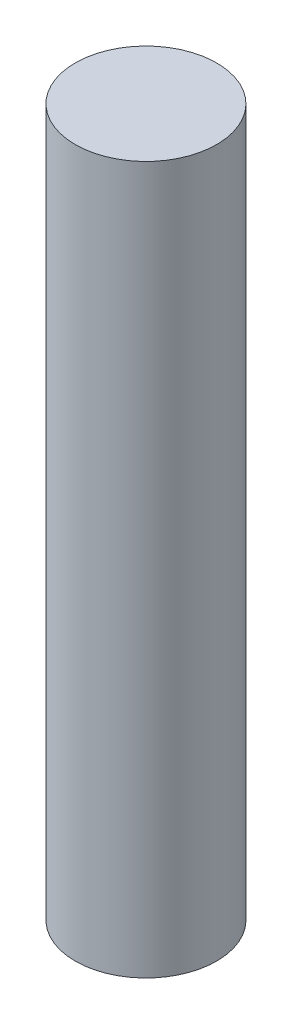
from build123d import *

# Parameters (mm, degrees)
ESQUISSE1_R        = 0.7
BOSS_EXTRU_1_DEPTH = 7


with BuildPart() as part:
    # Esquisse1 → Boss.-Extru.1 (new body)
    with BuildSketch(Plane(origin=(0, 0, 0), x_dir=(1, 0, 0), z_dir=(0, 1, 0))):
        with Locations(Location((0, 0, 0), (0, 0, 270))):
            Circle(ESQUISSE1_R)
    extrude(amount=BOSS_EXTRU_1_DEPTH)


solid = part.part
